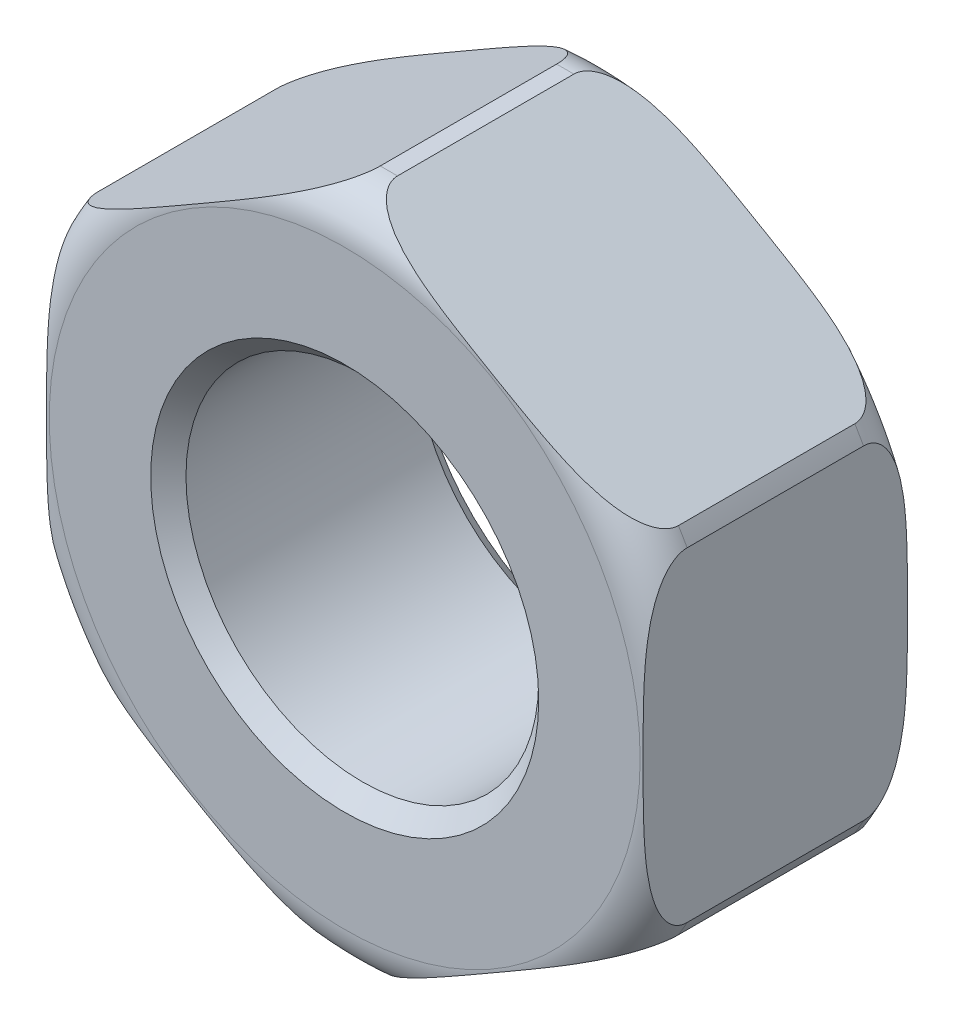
from build123d import *

# Parameters (mm, degrees)
ESQUISSE1_R             = 3.85
ESQUISSE1_R_2           = 2
EXTRUSION1_DEPTH        = 3
CONG_1_R                = 0.5
ESQUISSE2_OUTSIDE_W     = 11.96
ESQUISSE2_OUTSIDE_H     = 11.96
ENL_V_MAT_EXTRU_1_DEPTH = 3
CHANFREIN1_SIZE         = 0.2


with BuildPart() as part:
    # Esquisse1 → Extrusion1 (new body)
    with BuildSketch(Plane.XY):
        Circle(ESQUISSE1_R)
        Circle(ESQUISSE1_R_2, mode=Mode.SUBTRACT)
    extrude(amount=EXTRUSION1_DEPTH)

    # Cong_1
    cong_1_edges = [part.edges().sort_by_distance(p)[0] for p in [
        (-3.85, 0, 0),
        (-3.85, 0, 3),
    ]]
    fillet(cong_1_edges, radius=CONG_1_R)

    # Esquisse2 outside → Enl_v. mat.-Extru.1 (cut)
    with BuildSketch(Plane.XY.offset(3)):
        Rectangle(ESQUISSE2_OUTSIDE_W, ESQUISSE2_OUTSIDE_H)
        Polygon((3.38209884, 1.952655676), (0, 3.905311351), (-3.38209884, 1.952655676), (-3.38209884, -1.952655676), (0, -3.905311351), (3.38209884, -1.952655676), align=None, mode=Mode.SUBTRACT)
    extrude(amount=-ENL_V_MAT_EXTRU_1_DEPTH, mode=Mode.SUBTRACT)

    # Chanfrein1
    chanfrein1_edges = [part.edges().sort_by_distance(p)[0] for p in [
        (-2, 0, 0),
        (-2, 0, 3),
    ]]
    chamfer(chanfrein1_edges, length=CHANFREIN1_SIZE)


solid = part.part
